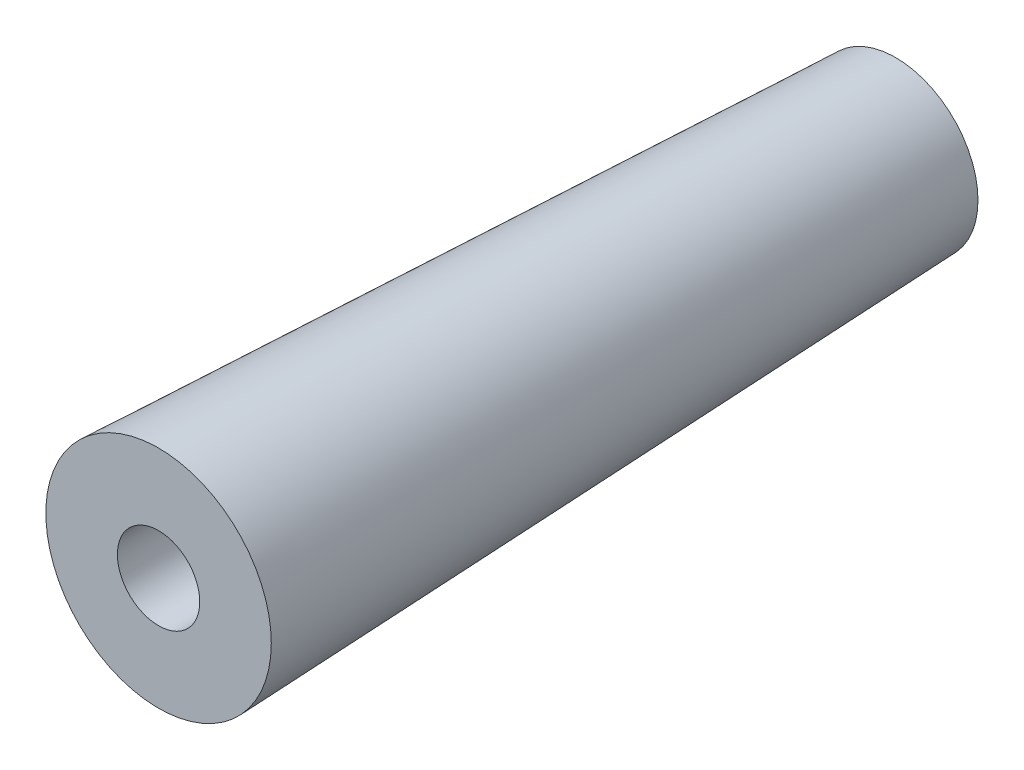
ISO-10303-21;
HEADER;
FILE_DESCRIPTION(('STEP AP214'),'2;1');
FILE_NAME('part.step','',(''),(''),'','','');
FILE_SCHEMA(('AUTOMOTIVE_DESIGN { 1 0 10303 214 1 1 1 1 }'));
ENDSEC;
DATA;
#1=APPLICATION_CONTEXT('core data for automotive mechanical design processes');
#2=APPLICATION_PROTOCOL_DEFINITION('international standard','automotive_design',2000,#1);
#3=PRODUCT_CONTEXT('',#1,'mechanical');
#4=PRODUCT('Part','Part','',(#3));
#5=PRODUCT_RELATED_PRODUCT_CATEGORY('part','',(#4));
#6=PRODUCT_DEFINITION_FORMATION('','',#4);
#7=PRODUCT_DEFINITION_CONTEXT('part definition',#1,'design');
#8=PRODUCT_DEFINITION('design','',#6,#7);
#9=PRODUCT_DEFINITION_SHAPE('','',#8);
#10=(LENGTH_UNIT() NAMED_UNIT(*) SI_UNIT(.MILLI.,.METRE.));
#11=(NAMED_UNIT(*) PLANE_ANGLE_UNIT() SI_UNIT($,.RADIAN.));
#12=(NAMED_UNIT(*) SI_UNIT($,.STERADIAN.) SOLID_ANGLE_UNIT());
#13=UNCERTAINTY_MEASURE_WITH_UNIT(LENGTH_MEASURE(1.E-05),#10,'distance_accuracy_value','');
#14=(GEOMETRIC_REPRESENTATION_CONTEXT(3) GLOBAL_UNCERTAINTY_ASSIGNED_CONTEXT((#13)) GLOBAL_UNIT_ASSIGNED_CONTEXT((#10,
#11,#12)) REPRESENTATION_CONTEXT('',''));
#15=CARTESIAN_POINT('',(0.,0.,0.));
#16=DIRECTION('',(0.,0.,1.));
#17=DIRECTION('',(1.,0.,0.));
#18=AXIS2_PLACEMENT_3D('',#15,#16,#17);
#19=CARTESIAN_POINT('',(0.,0.,85.));
#20=DIRECTION('',(0.,0.,1.));
#21=DIRECTION('',(1.,0.,0.));
#22=AXIS2_PLACEMENT_3D('',#19,#20,#21);
#23=PLANE('',#22);
#24=CARTESIAN_POINT('',(0.,0.,85.));
#25=DIRECTION('',(0.,0.,1.));
#26=DIRECTION('',(1.,0.,0.));
#27=AXIS2_PLACEMENT_3D('',#24,#25,#26);
#28=CIRCLE('',#27,4.75);
#29=CARTESIAN_POINT('',(4.75,0.,85.));
#30=VERTEX_POINT('',#29);
#31=EDGE_CURVE('E45',#30,#30,#28,.T.);
#32=ORIENTED_EDGE('',*,*,#31,.F.);
#33=EDGE_LOOP('',(#32));
#34=FACE_BOUND('',#33,.T.);
#35=CARTESIAN_POINT('',(0.,0.,85.));
#36=DIRECTION('',(0.,0.,1.));
#37=DIRECTION('',(1.,0.,0.));
#38=AXIS2_PLACEMENT_3D('',#35,#36,#37);
#39=CIRCLE('',#38,13.);
#40=CARTESIAN_POINT('',(13.,0.,85.));
#41=VERTEX_POINT('',#40);
#42=EDGE_CURVE('E37',#41,#41,#39,.T.);
#43=ORIENTED_EDGE('',*,*,#42,.T.);
#44=EDGE_LOOP('',(#43));
#45=FACE_BOUND('',#44,.T.);
#46=ADVANCED_FACE('F30',(#34,#45),#23,.T.);
#47=CARTESIAN_POINT('',(0.,0.,0.));
#48=DIRECTION('',(0.,0.,1.));
#49=DIRECTION('',(1.,0.,0.));
#50=AXIS2_PLACEMENT_3D('',#47,#48,#49);
#51=PLANE('',#50);
#52=CARTESIAN_POINT('',(0.,0.,0.));
#53=DIRECTION('',(0.,0.,1.));
#54=DIRECTION('',(1.,0.,0.));
#55=AXIS2_PLACEMENT_3D('',#52,#53,#54);
#56=CIRCLE('',#55,4.75);
#57=CARTESIAN_POINT('',(4.75,0.,0.));
#58=VERTEX_POINT('',#57);
#59=EDGE_CURVE('E41',#58,#58,#56,.T.);
#60=ORIENTED_EDGE('',*,*,#59,.T.);
#61=EDGE_LOOP('',(#60));
#62=FACE_BOUND('',#61,.T.);
#63=CARTESIAN_POINT('',(0.,0.,0.));
#64=DIRECTION('',(0.,0.,1.));
#65=DIRECTION('',(1.,0.,0.));
#66=AXIS2_PLACEMENT_3D('',#63,#64,#65);
#67=CIRCLE('',#66,9.5);
#68=CARTESIAN_POINT('',(9.5,0.,0.));
#69=VERTEX_POINT('',#68);
#70=EDGE_CURVE('E10',#69,#69,#67,.T.);
#71=ORIENTED_EDGE('',*,*,#70,.F.);
#72=EDGE_LOOP('',(#71));
#73=FACE_BOUND('',#72,.T.);
#74=ADVANCED_FACE('F32',(#62,#73),#51,.F.);
#75=CARTESIAN_POINT('',(0.,0.,0.));
#76=DIRECTION('',(0.,0.,1.));
#77=DIRECTION('',(1.,0.,0.));
#78=AXIS2_PLACEMENT_3D('',#75,#76,#77);
#79=CONICAL_SURFACE('',#78,9.5,0.041153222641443);
#80=ORIENTED_EDGE('',*,*,#70,.T.);
#81=EDGE_LOOP('',(#80));
#82=FACE_BOUND('',#81,.T.);
#83=ORIENTED_EDGE('',*,*,#42,.F.);
#84=EDGE_LOOP('',(#83));
#85=FACE_BOUND('',#84,.T.);
#86=ADVANCED_FACE('F58',(#82,#85),#79,.T.);
#87=CARTESIAN_POINT('',(0.,0.,0.));
#88=DIRECTION('',(0.,0.,1.));
#89=DIRECTION('',(1.,0.,0.));
#90=AXIS2_PLACEMENT_3D('',#87,#88,#89);
#91=CYLINDRICAL_SURFACE('',#90,4.75);
#92=ORIENTED_EDGE('',*,*,#59,.F.);
#93=EDGE_LOOP('',(#92));
#94=FACE_BOUND('',#93,.T.);
#95=ORIENTED_EDGE('',*,*,#31,.T.);
#96=EDGE_LOOP('',(#95));
#97=FACE_BOUND('',#96,.T.);
#98=ADVANCED_FACE('F51',(#94,#97),#91,.F.);
#99=CLOSED_SHELL('',(#46,#74,#86,#98));
#100=MANIFOLD_SOLID_BREP('B2',#99);
#101=ADVANCED_BREP_SHAPE_REPRESENTATION('',(#18,#100),#14);
#102=SHAPE_DEFINITION_REPRESENTATION(#9,#101);
ENDSEC;
END-ISO-10303-21;
